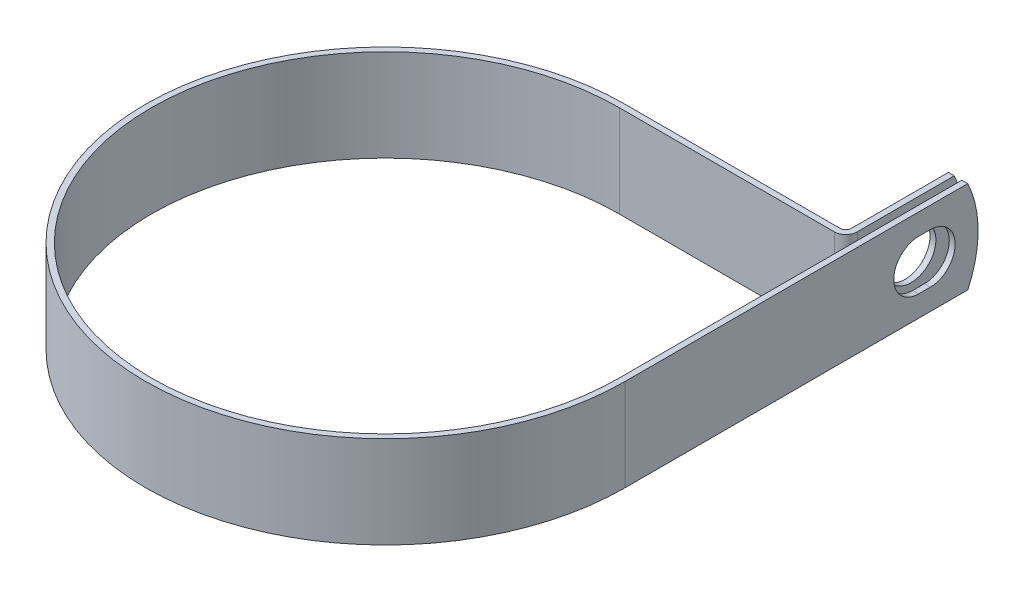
from build123d import *

# Parameters (mm, degrees)
EXTRUDE_THIN1_DEPTH = 9.525
SKETCH2_R           = 5.1562
CUT_EXTRUDE1_DEPTH  = 1.2192
CUT_EXTRUDE2_REACH  = 125.583
CUT_EXTRUDE3_DEPTH  = 121.383677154


with BuildPart() as part:
    # Sketch1 → Extrude-Thin1 (new, symmetric)
    with BuildSketch(Plane(origin=(0, 0, 0), x_dir=(1, 0, 0), z_dir=(0, 1, 0))):
        with BuildLine():
            Line((48.4124, 72.9996), (48.4124, 48.4124))
            Line((48.4124, 48.4124), (48.4124, 0))
            ThreePointArc((48.4124, 0), (-34.232736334, -34.232736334), (0, 48.4124))
            Line((0, 48.4124), (44.46016, 48.4124))
            ThreePointArc((44.46016, 48.4124), (46.141263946, 49.108736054), (46.8376, 50.78984))
            Line((46.8376, 50.78984), (46.8376, 72.9996))
            Line((46.8376, 72.9996), (45.6184, 72.9996))
            Line((45.6184, 72.9996), (45.6184, 50.78984))
            ThreePointArc((45.6184, 50.78984), (45.279159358, 49.970840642), (44.46016, 49.6316))
            Line((44.46016, 49.6316), (0, 49.6316))
            ThreePointArc((0, 49.6316), (-35.094840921, -35.094840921), (49.6316, 0))
            Line((49.6316, 0), (49.6316, 48.4124))
            Line((49.6316, 48.4124), (49.6316, 72.9996))
            Line((49.6316, 72.9996), (48.4124, 72.9996))
        make_face()
    extrude(amount=EXTRUDE_THIN1_DEPTH, both=True)

    # Sketch2 → Cut-Extrude1 (cut)
    with BuildSketch(Plane.ZY.offset(-45.6184)):
        with Locations((-61.8998, 0)):
            Circle(SKETCH2_R)
    extrude(amount=-CUT_EXTRUDE1_DEPTH, mode=Mode.SUBTRACT)

    # Sketch3 → Cut-Extrude2 (cut, up to next)
    with BuildSketch(Plane(origin=(49.6316, 0, 0), x_dir=(0, 0, -1), z_dir=(1, 0, 0)), mode=Mode.PRIVATE) as cut_extrude2_sk1:
        with BuildLine():
            Line((60.706, 5.1562), (63.0936, 5.1562))
            ThreePointArc((63.0936, 5.1562), (68.2498, 0), (63.0936, -5.1562))
            Line((63.0936, -5.1562), (60.706, -5.1562))
            ThreePointArc((60.706, -5.1562), (55.5498, 0), (60.706, 5.1562))
        make_face()
    cut_extrude2_tool1 = extrude(cut_extrude2_sk1.sketch, amount=-CUT_EXTRUDE2_REACH, mode=Mode.PRIVATE) & part.part
    add(cut_extrude2_tool1.solids().sort_by_distance((49.6316, 0, -61.8998))[0], mode=Mode.SUBTRACT)

    # Sketch4 → Cut-Extrude3 (cut, through all)
    with BuildSketch(Plane.ZY.offset(-45.6184)):
        with BuildLine():
            Line((-70.855063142, 9.525), (-72.9996, 9.525))
            Line((-72.9996, 9.525), (-72.9996, 0))
            ThreePointArc((-72.9996, 0), (-72.456838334, 4.881717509), (-70.855063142, 9.525))
        make_face()
        with BuildLine():
            ThreePointArc((-70.855063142, -9.525), (-72.456838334, -4.881717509), (-72.9996, 0))
            Line((-72.9996, 0), (-72.9996, -9.525))
            Line((-72.9996, -9.525), (-70.855063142, -9.525))
        make_face()
    extrude(amount=-CUT_EXTRUDE3_DEPTH, mode=Mode.SUBTRACT)


solid = part.part
